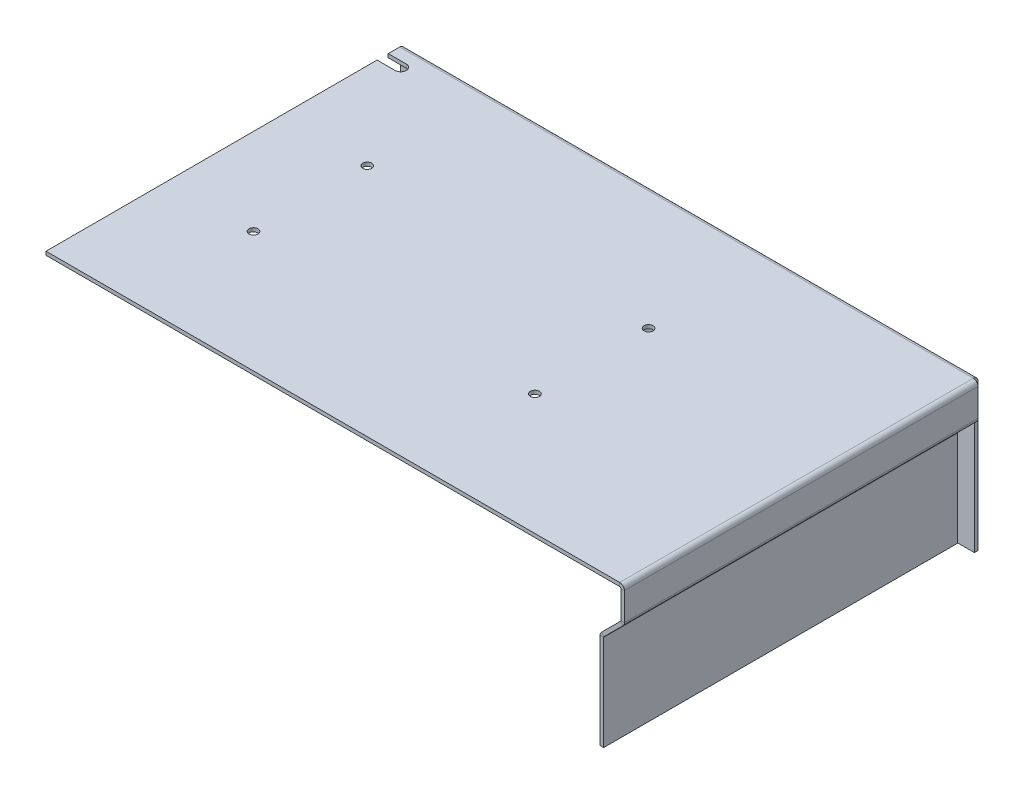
ISO-10303-21;
HEADER;
FILE_DESCRIPTION(('STEP AP214'),'2;1');
FILE_NAME('part.step','',(''),(''),'','','');
FILE_SCHEMA(('AUTOMOTIVE_DESIGN { 1 0 10303 214 1 1 1 1 }'));
ENDSEC;
DATA;
#1=APPLICATION_CONTEXT('core data for automotive mechanical design processes');
#2=APPLICATION_PROTOCOL_DEFINITION('international standard','automotive_design',2000,#1);
#3=PRODUCT_CONTEXT('',#1,'mechanical');
#4=PRODUCT('Part','Part','',(#3));
#5=PRODUCT_RELATED_PRODUCT_CATEGORY('part','',(#4));
#6=PRODUCT_DEFINITION_FORMATION('','',#4);
#7=PRODUCT_DEFINITION_CONTEXT('part definition',#1,'design');
#8=PRODUCT_DEFINITION('design','',#6,#7);
#9=PRODUCT_DEFINITION_SHAPE('','',#8);
#10=(LENGTH_UNIT() NAMED_UNIT(*) SI_UNIT(.MILLI.,.METRE.));
#11=(NAMED_UNIT(*) PLANE_ANGLE_UNIT() SI_UNIT($,.RADIAN.));
#12=(NAMED_UNIT(*) SI_UNIT($,.STERADIAN.) SOLID_ANGLE_UNIT());
#13=UNCERTAINTY_MEASURE_WITH_UNIT(LENGTH_MEASURE(1.E-05),#10,'distance_accuracy_value','');
#14=(GEOMETRIC_REPRESENTATION_CONTEXT(3) GLOBAL_UNCERTAINTY_ASSIGNED_CONTEXT((#13)) GLOBAL_UNIT_ASSIGNED_CONTEXT((#10,
#11,#12)) REPRESENTATION_CONTEXT('',''));
#15=CARTESIAN_POINT('',(0.,0.,0.));
#16=DIRECTION('',(0.,0.,1.));
#17=DIRECTION('',(1.,0.,0.));
#18=AXIS2_PLACEMENT_3D('',#15,#16,#17);
#19=CARTESIAN_POINT('',(-79.5,-1.,49.));
#20=DIRECTION('',(-1.,0.,0.));
#21=DIRECTION('',(0.,0.,1.));
#22=AXIS2_PLACEMENT_3D('',#19,#20,#21);
#23=PLANE('',#22);
#24=DIRECTION('',(0.,1.,0.));
#25=VECTOR('',#24,1.);
#26=CARTESIAN_POINT('',(-79.5,-1.,-45.85));
#27=LINE('',#26,#25);
#28=CARTESIAN_POINT('',(-79.5,-1.,-45.85));
#29=VERTEX_POINT('',#28);
#30=CARTESIAN_POINT('',(-79.5,0.,-45.85));
#31=VERTEX_POINT('',#30);
#32=EDGE_CURVE('E516',#29,#31,#27,.T.);
#33=ORIENTED_EDGE('',*,*,#32,.T.);
#34=DIRECTION('',(0.,0.,1.));
#35=VECTOR('',#34,1.);
#36=CARTESIAN_POINT('',(-79.5,0.,49.));
#37=LINE('',#36,#35);
#38=CARTESIAN_POINT('',(-79.5,0.,-49.));
#39=VERTEX_POINT('',#38);
#40=EDGE_CURVE('E368',#39,#31,#37,.T.);
#41=ORIENTED_EDGE('',*,*,#40,.F.);
#42=DIRECTION('',(0.,1.,0.));
#43=VECTOR('',#42,1.);
#44=CARTESIAN_POINT('',(-79.5,-1.,-49.));
#45=LINE('',#44,#43);
#46=CARTESIAN_POINT('',(-79.5,-1.,-49.));
#47=VERTEX_POINT('',#46);
#48=EDGE_CURVE('E374',#47,#39,#45,.T.);
#49=ORIENTED_EDGE('',*,*,#48,.F.);
#50=DIRECTION('',(0.,0.,1.));
#51=VECTOR('',#50,1.);
#52=CARTESIAN_POINT('',(-79.5,-1.,49.));
#53=LINE('',#52,#51);
#54=EDGE_CURVE('E355',#47,#29,#53,.T.);
#55=ORIENTED_EDGE('',*,*,#54,.T.);
#56=EDGE_LOOP('',(#33,#41,#49,#55));
#57=FACE_BOUND('',#56,.T.);
#58=ADVANCED_FACE('F118',(#57),#23,.T.);
#59=CARTESIAN_POINT('',(-79.5,-1.,49.));
#60=DIRECTION('',(0.,0.,1.));
#61=DIRECTION('',(1.,0.,0.));
#62=AXIS2_PLACEMENT_3D('',#59,#60,#61);
#63=PLANE('',#62);
#64=DIRECTION('',(1.,0.,0.));
#65=VECTOR('',#64,1.);
#66=CARTESIAN_POINT('',(-79.5,0.,49.));
#67=LINE('',#66,#65);
#68=CARTESIAN_POINT('',(-79.5,0.,49.));
#69=VERTEX_POINT('',#68);
#70=CARTESIAN_POINT('',(79.5,0.,49.));
#71=VERTEX_POINT('',#70);
#72=EDGE_CURVE('E371',#69,#71,#67,.T.);
#73=ORIENTED_EDGE('',*,*,#72,.F.);
#74=DIRECTION('',(0.,1.,0.));
#75=VECTOR('',#74,1.);
#76=CARTESIAN_POINT('',(-79.5,-1.,49.));
#77=LINE('',#76,#75);
#78=CARTESIAN_POINT('',(-79.5,-1.,49.));
#79=VERTEX_POINT('',#78);
#80=EDGE_CURVE('E127',#79,#69,#77,.T.);
#81=ORIENTED_EDGE('',*,*,#80,.F.);
#82=DIRECTION('',(1.,0.,0.));
#83=VECTOR('',#82,1.);
#84=CARTESIAN_POINT('',(-79.5,-1.,49.));
#85=LINE('',#84,#83);
#86=CARTESIAN_POINT('',(79.5,-1.,49.));
#87=VERTEX_POINT('',#86);
#88=EDGE_CURVE('E354',#79,#87,#85,.T.);
#89=ORIENTED_EDGE('',*,*,#88,.T.);
#90=DIRECTION('',(0.,1.,0.));
#91=VECTOR('',#90,1.);
#92=CARTESIAN_POINT('',(79.5,-1.,49.));
#93=LINE('',#92,#91);
#94=EDGE_CURVE('E13',#87,#71,#93,.T.);
#95=ORIENTED_EDGE('',*,*,#94,.T.);
#96=EDGE_LOOP('',(#73,#81,#89,#95));
#97=FACE_BOUND('',#96,.T.);
#98=ADVANCED_FACE('F394',(#97),#63,.T.);
#99=DIRECTION('',(0.,1.,0.));
#100=VECTOR('',#99,1.);
#101=CARTESIAN_POINT('',(-79.5,-1.,-42.75));
#102=LINE('',#101,#100);
#103=CARTESIAN_POINT('',(-79.5,-1.,-42.75));
#104=VERTEX_POINT('',#103);
#105=CARTESIAN_POINT('',(-79.5,0.,-42.75));
#106=VERTEX_POINT('',#105);
#107=EDGE_CURVE('E135',#104,#106,#102,.T.);
#108=ORIENTED_EDGE('',*,*,#107,.F.);
#109=EDGE_CURVE('E143',#104,#79,#53,.T.);
#110=ORIENTED_EDGE('',*,*,#109,.T.);
#111=ORIENTED_EDGE('',*,*,#80,.T.);
#112=EDGE_CURVE('E346',#106,#69,#37,.T.);
#113=ORIENTED_EDGE('',*,*,#112,.F.);
#114=EDGE_LOOP('',(#108,#110,#111,#113));
#115=FACE_BOUND('',#114,.T.);
#116=ADVANCED_FACE('F120',(#115),#23,.T.);
#117=CARTESIAN_POINT('',(0.,-1.,0.));
#118=DIRECTION('',(0.,-1.,0.));
#119=DIRECTION('',(0.,0.,-1.));
#120=AXIS2_PLACEMENT_3D('',#117,#118,#119);
#121=PLANE('',#120);
#122=CARTESIAN_POINT('',(-55.5,-1.,-16.));
#123=DIRECTION('',(0.,-1.,0.));
#124=DIRECTION('',(0.,0.,-1.));
#125=AXIS2_PLACEMENT_3D('',#122,#123,#124);
#126=CIRCLE('',#125,1.25);
#127=CARTESIAN_POINT('',(-55.5,-1.,-17.25));
#128=VERTEX_POINT('',#127);
#129=EDGE_CURVE('E575',#128,#128,#126,.T.);
#130=ORIENTED_EDGE('',*,*,#129,.F.);
#131=EDGE_LOOP('',(#130));
#132=FACE_BOUND('',#131,.T.);
#133=CARTESIAN_POINT('',(22.5,-1.,-16.));
#134=DIRECTION('',(0.,-1.,0.));
#135=DIRECTION('',(0.,0.,-1.));
#136=AXIS2_PLACEMENT_3D('',#133,#134,#135);
#137=CIRCLE('',#136,1.25);
#138=CARTESIAN_POINT('',(22.5,-1.,-17.25));
#139=VERTEX_POINT('',#138);
#140=EDGE_CURVE('E569',#139,#139,#137,.T.);
#141=ORIENTED_EDGE('',*,*,#140,.F.);
#142=EDGE_LOOP('',(#141));
#143=FACE_BOUND('',#142,.T.);
#144=CARTESIAN_POINT('',(22.5,-1.,15.5));
#145=DIRECTION('',(0.,-1.,0.));
#146=DIRECTION('',(0.,0.,-1.));
#147=AXIS2_PLACEMENT_3D('',#144,#145,#146);
#148=CIRCLE('',#147,1.25);
#149=CARTESIAN_POINT('',(22.5,-1.,14.25));
#150=VERTEX_POINT('',#149);
#151=EDGE_CURVE('E563',#150,#150,#148,.T.);
#152=ORIENTED_EDGE('',*,*,#151,.F.);
#153=EDGE_LOOP('',(#152));
#154=FACE_BOUND('',#153,.T.);
#155=CARTESIAN_POINT('',(-55.5,-1.,15.5));
#156=DIRECTION('',(0.,-1.,0.));
#157=DIRECTION('',(0.,0.,-1.));
#158=AXIS2_PLACEMENT_3D('',#155,#156,#157);
#159=CIRCLE('',#158,1.25);
#160=CARTESIAN_POINT('',(-55.5,-1.,14.25));
#161=VERTEX_POINT('',#160);
#162=EDGE_CURVE('E555',#161,#161,#159,.T.);
#163=ORIENTED_EDGE('',*,*,#162,.F.);
#164=EDGE_LOOP('',(#163));
#165=FACE_BOUND('',#164,.T.);
#166=DIRECTION('',(-1.,0.,0.));
#167=VECTOR('',#166,1.);
#168=CARTESIAN_POINT('',(-79.5,-1.,-45.85));
#169=LINE('',#168,#167);
#170=CARTESIAN_POINT('',(-74.5,-1.,-45.85));
#171=VERTEX_POINT('',#170);
#172=EDGE_CURVE('E347',#171,#29,#169,.T.);
#173=ORIENTED_EDGE('',*,*,#172,.T.);
#174=ORIENTED_EDGE('',*,*,#54,.F.);
#175=DIRECTION('',(-1.,0.,0.));
#176=VECTOR('',#175,1.);
#177=CARTESIAN_POINT('',(-79.5,-1.,-49.));
#178=LINE('',#177,#176);
#179=CARTESIAN_POINT('',(79.5,-1.,-49.));
#180=VERTEX_POINT('',#179);
#181=EDGE_CURVE('E356',#180,#47,#178,.T.);
#182=ORIENTED_EDGE('',*,*,#181,.F.);
#183=DIRECTION('',(0.,0.,-1.));
#184=VECTOR('',#183,1.);
#185=CARTESIAN_POINT('',(79.5,-1.,49.));
#186=LINE('',#185,#184);
#187=EDGE_CURVE('E359',#87,#180,#186,.T.);
#188=ORIENTED_EDGE('',*,*,#187,.F.);
#189=ORIENTED_EDGE('',*,*,#88,.F.);
#190=ORIENTED_EDGE('',*,*,#109,.F.);
#191=DIRECTION('',(1.,0.,0.));
#192=VECTOR('',#191,1.);
#193=CARTESIAN_POINT('',(-79.5,-1.,-42.75));
#194=LINE('',#193,#192);
#195=CARTESIAN_POINT('',(-74.5,-1.,-42.75));
#196=VERTEX_POINT('',#195);
#197=EDGE_CURVE('E336',#104,#196,#194,.T.);
#198=ORIENTED_EDGE('',*,*,#197,.T.);
#199=CARTESIAN_POINT('',(-74.5,-1.,-44.3));
#200=DIRECTION('',(0.,1.,0.));
#201=DIRECTION('',(0.,0.,1.));
#202=AXIS2_PLACEMENT_3D('',#199,#200,#201);
#203=CIRCLE('',#202,1.55);
#204=EDGE_CURVE('E342',#196,#171,#203,.T.);
#205=ORIENTED_EDGE('',*,*,#204,.T.);
#206=EDGE_LOOP('',(#173,#174,#182,#188,#189,#190,#198,#205));
#207=FACE_BOUND('',#206,.T.);
#208=ADVANCED_FACE('F351',(#132,#143,#154,#165,#207),#121,.T.);
#209=CARTESIAN_POINT('',(0.,0.,0.));
#210=DIRECTION('',(0.,-1.,0.));
#211=DIRECTION('',(0.,0.,-1.));
#212=AXIS2_PLACEMENT_3D('',#209,#210,#211);
#213=PLANE('',#212);
#214=CARTESIAN_POINT('',(-55.5,0.,-16.));
#215=DIRECTION('',(0.,1.,0.));
#216=DIRECTION('',(0.,0.,1.));
#217=AXIS2_PLACEMENT_3D('',#214,#215,#216);
#218=CIRCLE('',#217,1.25);
#219=CARTESIAN_POINT('',(-55.5,0.,-14.75));
#220=VERTEX_POINT('',#219);
#221=EDGE_CURVE('E578',#220,#220,#218,.T.);
#222=ORIENTED_EDGE('',*,*,#221,.F.);
#223=EDGE_LOOP('',(#222));
#224=FACE_BOUND('',#223,.T.);
#225=CARTESIAN_POINT('',(22.5,0.,-16.));
#226=DIRECTION('',(0.,1.,0.));
#227=DIRECTION('',(0.,0.,1.));
#228=AXIS2_PLACEMENT_3D('',#225,#226,#227);
#229=CIRCLE('',#228,1.25);
#230=CARTESIAN_POINT('',(22.5,0.,-14.75));
#231=VERTEX_POINT('',#230);
#232=EDGE_CURVE('E572',#231,#231,#229,.T.);
#233=ORIENTED_EDGE('',*,*,#232,.F.);
#234=EDGE_LOOP('',(#233));
#235=FACE_BOUND('',#234,.T.);
#236=CARTESIAN_POINT('',(22.5,0.,15.5));
#237=DIRECTION('',(0.,1.,0.));
#238=DIRECTION('',(0.,0.,1.));
#239=AXIS2_PLACEMENT_3D('',#236,#237,#238);
#240=CIRCLE('',#239,1.25);
#241=CARTESIAN_POINT('',(22.5,0.,16.75));
#242=VERTEX_POINT('',#241);
#243=EDGE_CURVE('E566',#242,#242,#240,.T.);
#244=ORIENTED_EDGE('',*,*,#243,.F.);
#245=EDGE_LOOP('',(#244));
#246=FACE_BOUND('',#245,.T.);
#247=CARTESIAN_POINT('',(-55.5,0.,15.5));
#248=DIRECTION('',(0.,1.,0.));
#249=DIRECTION('',(0.,0.,1.));
#250=AXIS2_PLACEMENT_3D('',#247,#248,#249);
#251=CIRCLE('',#250,1.25);
#252=CARTESIAN_POINT('',(-55.5,0.,16.75));
#253=VERTEX_POINT('',#252);
#254=EDGE_CURVE('E560',#253,#253,#251,.T.);
#255=ORIENTED_EDGE('',*,*,#254,.F.);
#256=EDGE_LOOP('',(#255));
#257=FACE_BOUND('',#256,.T.);
#258=ORIENTED_EDGE('',*,*,#40,.T.);
#259=DIRECTION('',(-1.,0.,0.));
#260=VECTOR('',#259,1.);
#261=CARTESIAN_POINT('',(-79.5,0.,-45.85));
#262=LINE('',#261,#260);
#263=CARTESIAN_POINT('',(-74.5,0.,-45.85));
#264=VERTEX_POINT('',#263);
#265=EDGE_CURVE('E343',#264,#31,#262,.T.);
#266=ORIENTED_EDGE('',*,*,#265,.F.);
#267=CARTESIAN_POINT('',(-74.5,0.,-44.3));
#268=DIRECTION('',(0.,1.,0.));
#269=DIRECTION('',(0.,0.,1.));
#270=AXIS2_PLACEMENT_3D('',#267,#268,#269);
#271=CIRCLE('',#270,1.55);
#272=CARTESIAN_POINT('',(-74.5,0.,-42.75));
#273=VERTEX_POINT('',#272);
#274=EDGE_CURVE('E550',#273,#264,#271,.T.);
#275=ORIENTED_EDGE('',*,*,#274,.F.);
#276=DIRECTION('',(1.,0.,0.));
#277=VECTOR('',#276,1.);
#278=CARTESIAN_POINT('',(-79.5,0.,-42.75));
#279=LINE('',#278,#277);
#280=EDGE_CURVE('E553',#106,#273,#279,.T.);
#281=ORIENTED_EDGE('',*,*,#280,.F.);
#282=ORIENTED_EDGE('',*,*,#112,.T.);
#283=ORIENTED_EDGE('',*,*,#72,.T.);
#284=DIRECTION('',(0.,0.,-1.));
#285=VECTOR('',#284,1.);
#286=CARTESIAN_POINT('',(79.5,0.,49.));
#287=LINE('',#286,#285);
#288=CARTESIAN_POINT('',(79.5,0.,-49.));
#289=VERTEX_POINT('',#288);
#290=EDGE_CURVE('E212',#71,#289,#287,.T.);
#291=ORIENTED_EDGE('',*,*,#290,.T.);
#292=DIRECTION('',(-1.,0.,0.));
#293=VECTOR('',#292,1.);
#294=CARTESIAN_POINT('',(-79.5,0.,-49.));
#295=LINE('',#294,#293);
#296=EDGE_CURVE('E365',#289,#39,#295,.T.);
#297=ORIENTED_EDGE('',*,*,#296,.T.);
#298=EDGE_LOOP('',(#258,#266,#275,#281,#282,#283,#291,#297));
#299=FACE_BOUND('',#298,.T.);
#300=ADVANCED_FACE('F391',(#224,#235,#246,#257,#299),#213,.F.);
#301=CARTESIAN_POINT('',(-79.5,-1.3,-49.));
#302=DIRECTION('',(-1.,0.,0.));
#303=DIRECTION('',(0.,0.,1.));
#304=AXIS2_PLACEMENT_3D('',#301,#302,#303);
#305=PLANE('',#304);
#306=DIRECTION('',(0.,0.,-1.));
#307=VECTOR('',#306,1.);
#308=CARTESIAN_POINT('',(-79.5,-1.3,-50.2999999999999));
#309=LINE('',#308,#307);
#310=CARTESIAN_POINT('',(-79.5,-1.3,-49.3));
#311=VERTEX_POINT('',#310);
#312=CARTESIAN_POINT('',(-79.5,-1.3,-50.3));
#313=VERTEX_POINT('',#312);
#314=EDGE_CURVE('E179',#311,#313,#309,.T.);
#315=ORIENTED_EDGE('',*,*,#314,.F.);
#316=CARTESIAN_POINT('',(-79.5,-1.3,-49.));
#317=DIRECTION('',(1.,0.,0.));
#318=DIRECTION('',(0.,0.,-1.));
#319=AXIS2_PLACEMENT_3D('',#316,#317,#318);
#320=CIRCLE('',#319,0.300000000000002);
#321=EDGE_CURVE('E389',#47,#311,#320,.F.);
#322=ORIENTED_EDGE('',*,*,#321,.F.);
#323=ORIENTED_EDGE('',*,*,#48,.T.);
#324=CARTESIAN_POINT('',(-79.5,-1.3,-49.));
#325=DIRECTION('',(1.,0.,0.));
#326=DIRECTION('',(0.,0.,-1.));
#327=AXIS2_PLACEMENT_3D('',#324,#325,#326);
#328=CIRCLE('',#327,1.3);
#329=EDGE_CURVE('E157',#39,#313,#328,.F.);
#330=ORIENTED_EDGE('',*,*,#329,.T.);
#331=EDGE_LOOP('',(#315,#322,#323,#330));
#332=FACE_BOUND('',#331,.T.);
#333=ADVANCED_FACE('F586',(#332),#305,.T.);
#334=CARTESIAN_POINT('',(79.5,-1.3,-49.));
#335=DIRECTION('',(-1.,0.,0.));
#336=DIRECTION('',(0.,0.,1.));
#337=AXIS2_PLACEMENT_3D('',#334,#335,#336);
#338=PLANE('',#337);
#339=CARTESIAN_POINT('',(79.5,-1.3,-49.));
#340=DIRECTION('',(1.,0.,0.));
#341=DIRECTION('',(0.,0.,-1.));
#342=AXIS2_PLACEMENT_3D('',#339,#340,#341);
#343=CIRCLE('',#342,0.300000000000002);
#344=CARTESIAN_POINT('',(79.5,-1.3,-49.3));
#345=VERTEX_POINT('',#344);
#346=EDGE_CURVE('E409',#345,#180,#343,.T.);
#347=ORIENTED_EDGE('',*,*,#346,.F.);
#348=DIRECTION('',(0.,0.,-1.));
#349=VECTOR('',#348,1.);
#350=CARTESIAN_POINT('',(79.5,-1.3,-49.3));
#351=LINE('',#350,#349);
#352=CARTESIAN_POINT('',(79.5,-1.29999999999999,-50.3));
#353=VERTEX_POINT('',#352);
#354=EDGE_CURVE('E387',#345,#353,#351,.T.);
#355=ORIENTED_EDGE('',*,*,#354,.T.);
#356=CARTESIAN_POINT('',(79.5,-1.3,-49.));
#357=DIRECTION('',(1.,0.,0.));
#358=DIRECTION('',(0.,0.,-1.));
#359=AXIS2_PLACEMENT_3D('',#356,#357,#358);
#360=CIRCLE('',#359,1.3);
#361=EDGE_CURVE('E186',#353,#289,#360,.T.);
#362=ORIENTED_EDGE('',*,*,#361,.T.);
#363=DIRECTION('',(0.,1.,0.));
#364=VECTOR('',#363,1.);
#365=CARTESIAN_POINT('',(79.5,-1.,-49.));
#366=LINE('',#365,#364);
#367=EDGE_CURVE('E122',#180,#289,#366,.T.);
#368=ORIENTED_EDGE('',*,*,#367,.F.);
#369=EDGE_LOOP('',(#347,#355,#362,#368));
#370=FACE_BOUND('',#369,.T.);
#371=ADVANCED_FACE('F385',(#370),#338,.F.);
#372=CARTESIAN_POINT('',(79.5,-1.3,-49.));
#373=DIRECTION('',(1.,0.,0.));
#374=DIRECTION('',(0.,0.,-1.));
#375=AXIS2_PLACEMENT_3D('',#372,#373,#374);
#376=CYLINDRICAL_SURFACE('',#375,1.3);
#377=ORIENTED_EDGE('',*,*,#296,.F.);
#378=ORIENTED_EDGE('',*,*,#361,.F.);
#379=DIRECTION('',(1.,0.,0.));
#380=VECTOR('',#379,1.);
#381=CARTESIAN_POINT('',(0.,-1.29999999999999,-50.3));
#382=LINE('',#381,#380);
#383=EDGE_CURVE('E418',#313,#353,#382,.T.);
#384=ORIENTED_EDGE('',*,*,#383,.F.);
#385=ORIENTED_EDGE('',*,*,#329,.F.);
#386=EDGE_LOOP('',(#377,#378,#384,#385));
#387=FACE_BOUND('',#386,.T.);
#388=ADVANCED_FACE('F383',(#387),#376,.T.);
#389=CARTESIAN_POINT('',(79.5,-1.3,-49.));
#390=DIRECTION('',(1.,0.,0.));
#391=DIRECTION('',(0.,0.,-1.));
#392=AXIS2_PLACEMENT_3D('',#389,#390,#391);
#393=CYLINDRICAL_SURFACE('',#392,0.300000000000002);
#394=ORIENTED_EDGE('',*,*,#181,.T.);
#395=ORIENTED_EDGE('',*,*,#321,.T.);
#396=DIRECTION('',(-1.,0.,0.));
#397=VECTOR('',#396,1.);
#398=CARTESIAN_POINT('',(-79.5,-1.3,-49.3));
#399=LINE('',#398,#397);
#400=EDGE_CURVE('E415',#311,#345,#399,.F.);
#401=ORIENTED_EDGE('',*,*,#400,.T.);
#402=ORIENTED_EDGE('',*,*,#346,.T.);
#403=EDGE_LOOP('',(#394,#395,#401,#402));
#404=FACE_BOUND('',#403,.T.);
#405=ADVANCED_FACE('F629',(#404),#393,.F.);
#406=CARTESIAN_POINT('',(79.5,-0.999999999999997,-50.3));
#407=DIRECTION('',(1.,0.,0.));
#408=DIRECTION('',(0.,1.,0.));
#409=AXIS2_PLACEMENT_3D('',#406,#407,#408);
#410=PLANE('',#409);
#411=DIRECTION('',(0.,1.,0.));
#412=VECTOR('',#411,1.);
#413=CARTESIAN_POINT('',(79.5,-0.999999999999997,-50.3));
#414=LINE('',#413,#412);
#415=CARTESIAN_POINT('',(79.4999999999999,-42.,-50.3000000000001));
#416=VERTEX_POINT('',#415);
#417=EDGE_CURVE('E431',#416,#353,#414,.T.);
#418=ORIENTED_EDGE('',*,*,#417,.T.);
#419=ORIENTED_EDGE('',*,*,#354,.F.);
#420=DIRECTION('',(0.,-1.,0.));
#421=VECTOR('',#420,1.);
#422=CARTESIAN_POINT('',(79.5,0.,-49.3));
#423=LINE('',#422,#421);
#424=CARTESIAN_POINT('',(79.4999999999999,-42.,-49.3000000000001));
#425=VERTEX_POINT('',#424);
#426=EDGE_CURVE('E423',#425,#345,#423,.F.);
#427=ORIENTED_EDGE('',*,*,#426,.F.);
#428=DIRECTION('',(0.,0.,1.));
#429=VECTOR('',#428,1.);
#430=CARTESIAN_POINT('',(79.4999999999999,-42.,-50.3000000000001));
#431=LINE('',#430,#429);
#432=EDGE_CURVE('E411',#416,#425,#431,.T.);
#433=ORIENTED_EDGE('',*,*,#432,.F.);
#434=EDGE_LOOP('',(#418,#419,#427,#433));
#435=FACE_BOUND('',#434,.T.);
#436=ADVANCED_FACE('F632',(#435),#410,.T.);
#437=CARTESIAN_POINT('',(-79.5,-42.,-50.3000000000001));
#438=DIRECTION('',(-1.,0.,0.));
#439=DIRECTION('',(0.,-1.,0.));
#440=AXIS2_PLACEMENT_3D('',#437,#438,#439);
#441=PLANE('',#440);
#442=DIRECTION('',(0.,1.,0.));
#443=VECTOR('',#442,1.);
#444=CARTESIAN_POINT('',(-79.5,2.0105868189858E-13,-49.3));
#445=LINE('',#444,#443);
#446=CARTESIAN_POINT('',(-79.5,-42.,-49.3000000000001));
#447=VERTEX_POINT('',#446);
#448=EDGE_CURVE('E206',#311,#447,#445,.F.);
#449=ORIENTED_EDGE('',*,*,#448,.F.);
#450=ORIENTED_EDGE('',*,*,#314,.T.);
#451=DIRECTION('',(0.,-1.,0.));
#452=VECTOR('',#451,1.);
#453=CARTESIAN_POINT('',(-79.5,-42.,-50.3000000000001));
#454=LINE('',#453,#452);
#455=CARTESIAN_POINT('',(-79.5,-42.,-50.3000000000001));
#456=VERTEX_POINT('',#455);
#457=EDGE_CURVE('E426',#313,#456,#454,.T.);
#458=ORIENTED_EDGE('',*,*,#457,.T.);
#459=DIRECTION('',(0.,0.,1.));
#460=VECTOR('',#459,1.);
#461=CARTESIAN_POINT('',(-79.5,-42.,-50.3000000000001));
#462=LINE('',#461,#460);
#463=EDGE_CURVE('E434',#456,#447,#462,.T.);
#464=ORIENTED_EDGE('',*,*,#463,.T.);
#465=EDGE_LOOP('',(#449,#450,#458,#464));
#466=FACE_BOUND('',#465,.T.);
#467=ADVANCED_FACE('F636',(#466),#441,.T.);
#468=CARTESIAN_POINT('',(0.,1.77640794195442E-13,-50.3));
#469=DIRECTION('',(0.,0.,-1.));
#470=DIRECTION('',(0.,1.,0.));
#471=AXIS2_PLACEMENT_3D('',#468,#469,#470);
#472=PLANE('',#471);
#473=ORIENTED_EDGE('',*,*,#457,.F.);
#474=ORIENTED_EDGE('',*,*,#383,.T.);
#475=ORIENTED_EDGE('',*,*,#417,.F.);
#476=DIRECTION('',(1.,0.,0.));
#477=VECTOR('',#476,1.);
#478=CARTESIAN_POINT('',(79.4999999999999,-42.,-50.3000000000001));
#479=LINE('',#478,#477);
#480=EDGE_CURVE('E428',#456,#416,#479,.T.);
#481=ORIENTED_EDGE('',*,*,#480,.F.);
#482=EDGE_LOOP('',(#473,#474,#475,#481));
#483=FACE_BOUND('',#482,.T.);
#484=ADVANCED_FACE('F639',(#483),#472,.T.);
#485=CARTESIAN_POINT('',(0.,1.74149312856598E-13,-49.3));
#486=DIRECTION('',(0.,0.,-1.));
#487=DIRECTION('',(0.,1.,0.));
#488=AXIS2_PLACEMENT_3D('',#485,#486,#487);
#489=PLANE('',#488);
#490=ORIENTED_EDGE('',*,*,#400,.F.);
#491=ORIENTED_EDGE('',*,*,#448,.T.);
#492=DIRECTION('',(-1.,0.,0.));
#493=VECTOR('',#492,1.);
#494=CARTESIAN_POINT('',(0.,-42.,-49.3000000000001));
#495=LINE('',#494,#493);
#496=EDGE_CURVE('E421',#447,#425,#495,.F.);
#497=ORIENTED_EDGE('',*,*,#496,.T.);
#498=ORIENTED_EDGE('',*,*,#426,.T.);
#499=EDGE_LOOP('',(#490,#491,#497,#498));
#500=FACE_BOUND('',#499,.T.);
#501=ADVANCED_FACE('F644',(#500),#489,.F.);
#502=CARTESIAN_POINT('',(79.4999999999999,-42.,-50.3000000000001));
#503=DIRECTION('',(0.,-1.,0.));
#504=DIRECTION('',(0.,0.,-1.));
#505=AXIS2_PLACEMENT_3D('',#502,#503,#504);
#506=PLANE('',#505);
#507=ORIENTED_EDGE('',*,*,#496,.F.);
#508=ORIENTED_EDGE('',*,*,#463,.F.);
#509=ORIENTED_EDGE('',*,*,#480,.T.);
#510=ORIENTED_EDGE('',*,*,#432,.T.);
#511=EDGE_LOOP('',(#507,#508,#509,#510));
#512=FACE_BOUND('',#511,.T.);
#513=ADVANCED_FACE('F641',(#512),#506,.T.);
#514=CARTESIAN_POINT('',(79.5,-1.3,-49.));
#515=DIRECTION('',(0.,0.,-1.));
#516=DIRECTION('',(-1.,0.,0.));
#517=AXIS2_PLACEMENT_3D('',#514,#515,#516);
#518=PLANE('',#517);
#519=DIRECTION('',(1.,0.,0.));
#520=VECTOR('',#519,1.);
#521=CARTESIAN_POINT('',(80.8,-1.29999999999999,-49.));
#522=LINE('',#521,#520);
#523=CARTESIAN_POINT('',(79.8,-1.3,-49.));
#524=VERTEX_POINT('',#523);
#525=CARTESIAN_POINT('',(80.8,-1.29999999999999,-49.));
#526=VERTEX_POINT('',#525);
#527=EDGE_CURVE('E228',#524,#526,#522,.T.);
#528=ORIENTED_EDGE('',*,*,#527,.F.);
#529=CARTESIAN_POINT('',(79.5,-1.3,-49.));
#530=DIRECTION('',(0.,0.,1.));
#531=DIRECTION('',(1.,0.,0.));
#532=AXIS2_PLACEMENT_3D('',#529,#530,#531);
#533=CIRCLE('',#532,0.299999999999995);
#534=EDGE_CURVE('E379',#180,#524,#533,.F.);
#535=ORIENTED_EDGE('',*,*,#534,.F.);
#536=ORIENTED_EDGE('',*,*,#367,.T.);
#537=CARTESIAN_POINT('',(79.5,-1.3,-49.));
#538=DIRECTION('',(0.,0.,1.));
#539=DIRECTION('',(1.,0.,0.));
#540=AXIS2_PLACEMENT_3D('',#537,#538,#539);
#541=CIRCLE('',#540,1.29999999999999);
#542=EDGE_CURVE('E166',#289,#526,#541,.F.);
#543=ORIENTED_EDGE('',*,*,#542,.T.);
#544=EDGE_LOOP('',(#528,#535,#536,#543));
#545=FACE_BOUND('',#544,.T.);
#546=ADVANCED_FACE('F378',(#545),#518,.T.);
#547=CARTESIAN_POINT('',(79.5,-1.3,49.));
#548=DIRECTION('',(0.,0.,-1.));
#549=DIRECTION('',(-1.,0.,0.));
#550=AXIS2_PLACEMENT_3D('',#547,#548,#549);
#551=PLANE('',#550);
#552=CARTESIAN_POINT('',(79.5,-1.3,49.));
#553=DIRECTION('',(0.,0.,1.));
#554=DIRECTION('',(1.,0.,0.));
#555=AXIS2_PLACEMENT_3D('',#552,#553,#554);
#556=CIRCLE('',#555,0.299999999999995);
#557=CARTESIAN_POINT('',(79.8,-1.3,49.));
#558=VERTEX_POINT('',#557);
#559=EDGE_CURVE('E399',#558,#87,#556,.T.);
#560=ORIENTED_EDGE('',*,*,#559,.F.);
#561=DIRECTION('',(1.,0.,0.));
#562=VECTOR('',#561,1.);
#563=CARTESIAN_POINT('',(79.8,-1.3,49.));
#564=LINE('',#563,#562);
#565=CARTESIAN_POINT('',(80.8,-1.29999999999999,49.));
#566=VERTEX_POINT('',#565);
#567=EDGE_CURVE('E443',#558,#566,#564,.T.);
#568=ORIENTED_EDGE('',*,*,#567,.T.);
#569=CARTESIAN_POINT('',(79.5,-1.3,49.));
#570=DIRECTION('',(0.,0.,1.));
#571=DIRECTION('',(1.,0.,0.));
#572=AXIS2_PLACEMENT_3D('',#569,#570,#571);
#573=CIRCLE('',#572,1.29999999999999);
#574=EDGE_CURVE('E233',#566,#71,#573,.T.);
#575=ORIENTED_EDGE('',*,*,#574,.T.);
#576=ORIENTED_EDGE('',*,*,#94,.F.);
#577=EDGE_LOOP('',(#560,#568,#575,#576));
#578=FACE_BOUND('',#577,.T.);
#579=ADVANCED_FACE('F398',(#578),#551,.F.);
#580=CARTESIAN_POINT('',(79.5,-1.3,49.));
#581=DIRECTION('',(0.,0.,1.));
#582=DIRECTION('',(1.,0.,0.));
#583=AXIS2_PLACEMENT_3D('',#580,#581,#582);
#584=CYLINDRICAL_SURFACE('',#583,1.29999999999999);
#585=ORIENTED_EDGE('',*,*,#290,.F.);
#586=ORIENTED_EDGE('',*,*,#574,.F.);
#587=DIRECTION('',(0.,0.,1.));
#588=VECTOR('',#587,1.);
#589=CARTESIAN_POINT('',(80.8,-1.29999999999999,0.));
#590=LINE('',#589,#588);
#591=EDGE_CURVE('E445',#526,#566,#590,.T.);
#592=ORIENTED_EDGE('',*,*,#591,.F.);
#593=ORIENTED_EDGE('',*,*,#542,.F.);
#594=EDGE_LOOP('',(#585,#586,#592,#593));
#595=FACE_BOUND('',#594,.T.);
#596=ADVANCED_FACE('F656',(#595),#584,.T.);
#597=CARTESIAN_POINT('',(79.5,-1.3,49.));
#598=DIRECTION('',(0.,0.,1.));
#599=DIRECTION('',(1.,0.,0.));
#600=AXIS2_PLACEMENT_3D('',#597,#598,#599);
#601=CYLINDRICAL_SURFACE('',#600,0.299999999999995);
#602=ORIENTED_EDGE('',*,*,#187,.T.);
#603=ORIENTED_EDGE('',*,*,#534,.T.);
#604=DIRECTION('',(0.,0.,-1.));
#605=VECTOR('',#604,1.);
#606=CARTESIAN_POINT('',(79.8,-1.3,-49.));
#607=LINE('',#606,#605);
#608=EDGE_CURVE('E403',#524,#558,#607,.F.);
#609=ORIENTED_EDGE('',*,*,#608,.T.);
#610=ORIENTED_EDGE('',*,*,#559,.T.);
#611=EDGE_LOOP('',(#602,#603,#609,#610));
#612=FACE_BOUND('',#611,.T.);
#613=ADVANCED_FACE('F402',(#612),#601,.F.);
#614=CARTESIAN_POINT('',(80.8,-0.999999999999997,49.));
#615=DIRECTION('',(0.,0.,1.));
#616=DIRECTION('',(1.,0.,0.));
#617=AXIS2_PLACEMENT_3D('',#614,#615,#616);
#618=PLANE('',#617);
#619=DIRECTION('',(0.,1.,0.));
#620=VECTOR('',#619,1.);
#621=CARTESIAN_POINT('',(80.8,-0.999999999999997,49.));
#622=LINE('',#621,#620);
#623=CARTESIAN_POINT('',(80.8,-9.,49.));
#624=VERTEX_POINT('',#623);
#625=EDGE_CURVE('E258',#624,#566,#622,.T.);
#626=ORIENTED_EDGE('',*,*,#625,.T.);
#627=ORIENTED_EDGE('',*,*,#567,.F.);
#628=DIRECTION('',(0.,-1.,0.));
#629=VECTOR('',#628,1.);
#630=CARTESIAN_POINT('',(79.8,2.75821032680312E-13,49.));
#631=LINE('',#630,#629);
#632=CARTESIAN_POINT('',(79.8,-9.,49.));
#633=VERTEX_POINT('',#632);
#634=EDGE_CURVE('E450',#633,#558,#631,.F.);
#635=ORIENTED_EDGE('',*,*,#634,.F.);
#636=DIRECTION('',(-1.,0.,0.));
#637=VECTOR('',#636,1.);
#638=CARTESIAN_POINT('',(80.8,-9.,49.));
#639=LINE('',#638,#637);
#640=EDGE_CURVE('E404',#624,#633,#639,.T.);
#641=ORIENTED_EDGE('',*,*,#640,.F.);
#642=EDGE_LOOP('',(#626,#627,#635,#641));
#643=FACE_BOUND('',#642,.T.);
#644=ADVANCED_FACE('F661',(#643),#618,.T.);
#645=CARTESIAN_POINT('',(80.8,-9.,-49.));
#646=DIRECTION('',(0.,0.,-1.));
#647=DIRECTION('',(-1.,0.,0.));
#648=AXIS2_PLACEMENT_3D('',#645,#646,#647);
#649=PLANE('',#648);
#650=DIRECTION('',(0.,1.,0.));
#651=VECTOR('',#650,1.);
#652=CARTESIAN_POINT('',(79.8,2.75821032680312E-13,-49.));
#653=LINE('',#652,#651);
#654=CARTESIAN_POINT('',(79.8,-9.,-49.));
#655=VERTEX_POINT('',#654);
#656=EDGE_CURVE('E249',#524,#655,#653,.F.);
#657=ORIENTED_EDGE('',*,*,#656,.F.);
#658=ORIENTED_EDGE('',*,*,#527,.T.);
#659=DIRECTION('',(0.,-1.,0.));
#660=VECTOR('',#659,1.);
#661=CARTESIAN_POINT('',(80.8,-9.,-49.));
#662=LINE('',#661,#660);
#663=CARTESIAN_POINT('',(80.8,-9.,-49.));
#664=VERTEX_POINT('',#663);
#665=EDGE_CURVE('E452',#526,#664,#662,.T.);
#666=ORIENTED_EDGE('',*,*,#665,.T.);
#667=DIRECTION('',(-1.,0.,0.));
#668=VECTOR('',#667,1.);
#669=CARTESIAN_POINT('',(80.8,-9.,-49.));
#670=LINE('',#669,#668);
#671=EDGE_CURVE('E457',#664,#655,#670,.T.);
#672=ORIENTED_EDGE('',*,*,#671,.T.);
#673=EDGE_LOOP('',(#657,#658,#666,#672));
#674=FACE_BOUND('',#673,.T.);
#675=ADVANCED_FACE('F664',(#674),#649,.T.);
#676=CARTESIAN_POINT('',(80.8,2.79312514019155E-13,0.));
#677=DIRECTION('',(1.,0.,0.));
#678=DIRECTION('',(0.,1.,0.));
#679=AXIS2_PLACEMENT_3D('',#676,#677,#678);
#680=PLANE('',#679);
#681=ORIENTED_EDGE('',*,*,#665,.F.);
#682=ORIENTED_EDGE('',*,*,#591,.T.);
#683=ORIENTED_EDGE('',*,*,#625,.F.);
#684=DIRECTION('',(0.,0.,1.));
#685=VECTOR('',#684,1.);
#686=CARTESIAN_POINT('',(80.8,-9.,49.));
#687=LINE('',#686,#685);
#688=EDGE_CURVE('E454',#664,#624,#687,.T.);
#689=ORIENTED_EDGE('',*,*,#688,.F.);
#690=EDGE_LOOP('',(#681,#682,#683,#689));
#691=FACE_BOUND('',#690,.T.);
#692=ADVANCED_FACE('F667',(#691),#680,.T.);
#693=CARTESIAN_POINT('',(79.8,2.75821032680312E-13,0.));
#694=DIRECTION('',(1.,0.,0.));
#695=DIRECTION('',(0.,1.,0.));
#696=AXIS2_PLACEMENT_3D('',#693,#694,#695);
#697=PLANE('',#696);
#698=ORIENTED_EDGE('',*,*,#608,.F.);
#699=ORIENTED_EDGE('',*,*,#656,.T.);
#700=DIRECTION('',(0.,0.,-1.));
#701=VECTOR('',#700,1.);
#702=CARTESIAN_POINT('',(79.8,-9.,0.));
#703=LINE('',#702,#701);
#704=EDGE_CURVE('E448',#655,#633,#703,.F.);
#705=ORIENTED_EDGE('',*,*,#704,.T.);
#706=ORIENTED_EDGE('',*,*,#634,.T.);
#707=EDGE_LOOP('',(#698,#699,#705,#706));
#708=FACE_BOUND('',#707,.T.);
#709=ADVANCED_FACE('F672',(#708),#697,.F.);
#710=CARTESIAN_POINT('',(79.5,-9.00000000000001,-49.));
#711=DIRECTION('',(0.,0.,-1.));
#712=DIRECTION('',(-1.,0.,0.));
#713=AXIS2_PLACEMENT_3D('',#710,#711,#712);
#714=PLANE('',#713);
#715=DIRECTION('',(0.707106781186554,-0.707106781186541,0.));
#716=VECTOR('',#715,1.);
#717=CARTESIAN_POINT('',(80.4192388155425,-9.91923881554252,-49.));
#718=LINE('',#717,#716);
#719=CARTESIAN_POINT('',(79.712132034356,-9.21213203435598,-49.));
#720=VERTEX_POINT('',#719);
#721=CARTESIAN_POINT('',(80.4192388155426,-9.91923881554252,-48.9999999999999));
#722=VERTEX_POINT('',#721);
#723=EDGE_CURVE('E270',#720,#722,#718,.T.);
#724=ORIENTED_EDGE('',*,*,#723,.F.);
#725=CARTESIAN_POINT('',(79.5,-9.00000000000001,-49.));
#726=DIRECTION('',(0.,0.,1.));
#727=DIRECTION('',(1.,0.,0.));
#728=AXIS2_PLACEMENT_3D('',#725,#726,#727);
#729=CIRCLE('',#728,0.300000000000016);
#730=EDGE_CURVE('E464',#655,#720,#729,.F.);
#731=ORIENTED_EDGE('',*,*,#730,.F.);
#732=ORIENTED_EDGE('',*,*,#671,.F.);
#733=CARTESIAN_POINT('',(79.5,-9.00000000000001,-48.9999999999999));
#734=DIRECTION('',(0.,0.,1.));
#735=DIRECTION('',(1.,0.,0.));
#736=AXIS2_PLACEMENT_3D('',#733,#734,#735);
#737=CIRCLE('',#736,1.30000000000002);
#738=EDGE_CURVE('E441',#664,#722,#737,.F.);
#739=ORIENTED_EDGE('',*,*,#738,.T.);
#740=EDGE_LOOP('',(#724,#731,#732,#739));
#741=FACE_BOUND('',#740,.T.);
#742=ADVANCED_FACE('F675',(#741),#714,.T.);
#743=CARTESIAN_POINT('',(79.5,-9.00000000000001,49.));
#744=DIRECTION('',(0.,0.,-1.));
#745=DIRECTION('',(-1.,0.,0.));
#746=AXIS2_PLACEMENT_3D('',#743,#744,#745);
#747=PLANE('',#746);
#748=CARTESIAN_POINT('',(79.5,-9.00000000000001,49.));
#749=DIRECTION('',(0.,0.,1.));
#750=DIRECTION('',(1.,0.,0.));
#751=AXIS2_PLACEMENT_3D('',#748,#749,#750);
#752=CIRCLE('',#751,0.300000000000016);
#753=CARTESIAN_POINT('',(79.712132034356,-9.21213203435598,49.));
#754=VERTEX_POINT('',#753);
#755=EDGE_CURVE('E461',#754,#633,#752,.T.);
#756=ORIENTED_EDGE('',*,*,#755,.F.);
#757=DIRECTION('',(0.707106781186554,-0.707106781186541,0.));
#758=VECTOR('',#757,1.);
#759=CARTESIAN_POINT('',(79.712132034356,-9.21213203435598,49.));
#760=LINE('',#759,#758);
#761=CARTESIAN_POINT('',(80.4192388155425,-9.91923881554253,49.));
#762=VERTEX_POINT('',#761);
#763=EDGE_CURVE('E473',#754,#762,#760,.T.);
#764=ORIENTED_EDGE('',*,*,#763,.T.);
#765=CARTESIAN_POINT('',(79.5,-9.00000000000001,49.));
#766=DIRECTION('',(0.,0.,1.));
#767=DIRECTION('',(1.,0.,0.));
#768=AXIS2_PLACEMENT_3D('',#765,#766,#767);
#769=CIRCLE('',#768,1.30000000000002);
#770=EDGE_CURVE('E279',#762,#624,#769,.T.);
#771=ORIENTED_EDGE('',*,*,#770,.T.);
#772=ORIENTED_EDGE('',*,*,#640,.T.);
#773=EDGE_LOOP('',(#756,#764,#771,#772));
#774=FACE_BOUND('',#773,.T.);
#775=ADVANCED_FACE('F678',(#774),#747,.F.);
#776=CARTESIAN_POINT('',(79.5,-9.00000000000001,49.));
#777=DIRECTION('',(0.,0.,1.));
#778=DIRECTION('',(0.707106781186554,-0.707106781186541,0.));
#779=AXIS2_PLACEMENT_3D('',#776,#777,#778);
#780=CYLINDRICAL_SURFACE('',#779,1.30000000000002);
#781=ORIENTED_EDGE('',*,*,#688,.T.);
#782=ORIENTED_EDGE('',*,*,#770,.F.);
#783=DIRECTION('',(0.,0.,1.));
#784=VECTOR('',#783,1.);
#785=CARTESIAN_POINT('',(80.4192388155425,-9.91923881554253,0.));
#786=LINE('',#785,#784);
#787=EDGE_CURVE('E475',#722,#762,#786,.T.);
#788=ORIENTED_EDGE('',*,*,#787,.F.);
#789=ORIENTED_EDGE('',*,*,#738,.F.);
#790=EDGE_LOOP('',(#781,#782,#788,#789));
#791=FACE_BOUND('',#790,.T.);
#792=ADVANCED_FACE('F681',(#791),#780,.T.);
#793=CARTESIAN_POINT('',(79.5,-9.00000000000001,49.));
#794=DIRECTION('',(0.,0.,1.));
#795=DIRECTION('',(0.707106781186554,-0.707106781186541,0.));
#796=AXIS2_PLACEMENT_3D('',#793,#794,#795);
#797=CYLINDRICAL_SURFACE('',#796,0.300000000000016);
#798=ORIENTED_EDGE('',*,*,#704,.F.);
#799=ORIENTED_EDGE('',*,*,#730,.T.);
#800=DIRECTION('',(0.,0.,-1.));
#801=VECTOR('',#800,1.);
#802=CARTESIAN_POINT('',(79.712132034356,-9.21213203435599,-49.));
#803=LINE('',#802,#801);
#804=EDGE_CURVE('E470',#720,#754,#803,.F.);
#805=ORIENTED_EDGE('',*,*,#804,.T.);
#806=ORIENTED_EDGE('',*,*,#755,.T.);
#807=EDGE_LOOP('',(#798,#799,#805,#806));
#808=FACE_BOUND('',#807,.T.);
#809=ADVANCED_FACE('F685',(#808),#797,.F.);
#810=CARTESIAN_POINT('',(80.5071067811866,-9.83137084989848,49.));
#811=DIRECTION('',(0.,0.,1.));
#812=DIRECTION('',(1.,0.,0.));
#813=AXIS2_PLACEMENT_3D('',#810,#811,#812);
#814=PLANE('',#813);
#815=DIRECTION('',(0.707106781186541,0.707106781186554,0.));
#816=VECTOR('',#815,1.);
#817=CARTESIAN_POINT('',(80.5071067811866,-9.83137084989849,49.));
#818=LINE('',#817,#816);
#819=CARTESIAN_POINT('',(75.1431457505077,-15.1953318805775,49.));
#820=VERTEX_POINT('',#819);
#821=EDGE_CURVE('E492',#820,#762,#818,.T.);
#822=ORIENTED_EDGE('',*,*,#821,.T.);
#823=ORIENTED_EDGE('',*,*,#763,.F.);
#824=DIRECTION('',(-0.707106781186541,-0.707106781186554,0.));
#825=VECTOR('',#824,1.);
#826=CARTESIAN_POINT('',(44.4000000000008,-44.5242640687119,49.));
#827=LINE('',#826,#825);
#828=CARTESIAN_POINT('',(74.4360389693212,-14.4882250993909,49.));
#829=VERTEX_POINT('',#828);
#830=EDGE_CURVE('E484',#829,#754,#827,.F.);
#831=ORIENTED_EDGE('',*,*,#830,.F.);
#832=DIRECTION('',(-0.707106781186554,0.707106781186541,0.));
#833=VECTOR('',#832,1.);
#834=CARTESIAN_POINT('',(75.1431457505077,-15.1953318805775,49.));
#835=LINE('',#834,#833);
#836=EDGE_CURVE('E465',#820,#829,#835,.T.);
#837=ORIENTED_EDGE('',*,*,#836,.F.);
#838=EDGE_LOOP('',(#822,#823,#831,#837));
#839=FACE_BOUND('',#838,.T.);
#840=ADVANCED_FACE('F688',(#839),#814,.T.);
#841=CARTESIAN_POINT('',(75.1431457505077,-15.1953318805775,-49.));
#842=DIRECTION('',(0.,0.,-1.));
#843=DIRECTION('',(-1.,0.,0.));
#844=AXIS2_PLACEMENT_3D('',#841,#842,#843);
#845=PLANE('',#844);
#846=DIRECTION('',(0.707106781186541,0.707106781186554,0.));
#847=VECTOR('',#846,1.);
#848=CARTESIAN_POINT('',(44.4000000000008,-44.5242640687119,-49.));
#849=LINE('',#848,#847);
#850=CARTESIAN_POINT('',(74.4360389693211,-14.4882250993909,-49.));
#851=VERTEX_POINT('',#850);
#852=EDGE_CURVE('E478',#720,#851,#849,.F.);
#853=ORIENTED_EDGE('',*,*,#852,.F.);
#854=ORIENTED_EDGE('',*,*,#723,.T.);
#855=DIRECTION('',(-0.707106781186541,-0.707106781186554,0.));
#856=VECTOR('',#855,1.);
#857=CARTESIAN_POINT('',(75.1431457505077,-15.1953318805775,-49.));
#858=LINE('',#857,#856);
#859=CARTESIAN_POINT('',(75.1431457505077,-15.1953318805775,-49.));
#860=VERTEX_POINT('',#859);
#861=EDGE_CURVE('E487',#722,#860,#858,.T.);
#862=ORIENTED_EDGE('',*,*,#861,.T.);
#863=DIRECTION('',(-0.707106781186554,0.707106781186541,0.));
#864=VECTOR('',#863,1.);
#865=CARTESIAN_POINT('',(75.1431457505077,-15.1953318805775,-49.));
#866=LINE('',#865,#864);
#867=EDGE_CURVE('E495',#860,#851,#866,.T.);
#868=ORIENTED_EDGE('',*,*,#867,.T.);
#869=EDGE_LOOP('',(#853,#854,#862,#868));
#870=FACE_BOUND('',#869,.T.);
#871=ADVANCED_FACE('F692',(#870),#845,.T.);
#872=CARTESIAN_POINT('',(45.1071067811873,-45.2313708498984,0.));
#873=DIRECTION('',(0.707106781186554,-0.707106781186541,0.));
#874=DIRECTION('',(0.707106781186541,0.707106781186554,0.));
#875=AXIS2_PLACEMENT_3D('',#872,#873,#874);
#876=PLANE('',#875);
#877=ORIENTED_EDGE('',*,*,#861,.F.);
#878=ORIENTED_EDGE('',*,*,#787,.T.);
#879=ORIENTED_EDGE('',*,*,#821,.F.);
#880=DIRECTION('',(0.,0.,1.));
#881=VECTOR('',#880,1.);
#882=CARTESIAN_POINT('',(75.1431457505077,-15.1953318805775,49.));
#883=LINE('',#882,#881);
#884=EDGE_CURVE('E490',#860,#820,#883,.T.);
#885=ORIENTED_EDGE('',*,*,#884,.F.);
#886=EDGE_LOOP('',(#877,#878,#879,#885));
#887=FACE_BOUND('',#886,.T.);
#888=ADVANCED_FACE('F695',(#887),#876,.T.);
#889=CARTESIAN_POINT('',(44.4000000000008,-44.5242640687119,0.));
#890=DIRECTION('',(0.707106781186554,-0.707106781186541,0.));
#891=DIRECTION('',(0.707106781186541,0.707106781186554,0.));
#892=AXIS2_PLACEMENT_3D('',#889,#890,#891);
#893=PLANE('',#892);
#894=ORIENTED_EDGE('',*,*,#804,.F.);
#895=ORIENTED_EDGE('',*,*,#852,.T.);
#896=DIRECTION('',(0.,0.,-1.));
#897=VECTOR('',#896,1.);
#898=CARTESIAN_POINT('',(74.4360389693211,-14.4882250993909,0.));
#899=LINE('',#898,#897);
#900=EDGE_CURVE('E481',#851,#829,#899,.F.);
#901=ORIENTED_EDGE('',*,*,#900,.T.);
#902=ORIENTED_EDGE('',*,*,#830,.T.);
#903=EDGE_LOOP('',(#894,#895,#901,#902));
#904=FACE_BOUND('',#903,.T.);
#905=ADVANCED_FACE('F700',(#904),#893,.F.);
#906=CARTESIAN_POINT('',(75.3552777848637,-15.4074639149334,49.));
#907=DIRECTION('',(0.,0.,1.));
#908=DIRECTION('',(1.,0.,0.));
#909=AXIS2_PLACEMENT_3D('',#906,#907,#908);
#910=PLANE('',#909);
#911=DIRECTION('',(-1.,0.,0.));
#912=VECTOR('',#911,1.);
#913=CARTESIAN_POINT('',(74.0552777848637,-15.4074639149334,49.));
#914=LINE('',#913,#912);
#915=CARTESIAN_POINT('',(75.0552777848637,-15.4074639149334,49.));
#916=VERTEX_POINT('',#915);
#917=CARTESIAN_POINT('',(74.0552777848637,-15.4074639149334,49.));
#918=VERTEX_POINT('',#917);
#919=EDGE_CURVE('E512',#916,#918,#914,.T.);
#920=ORIENTED_EDGE('',*,*,#919,.F.);
#921=CARTESIAN_POINT('',(75.3552777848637,-15.4074639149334,49.));
#922=DIRECTION('',(0.,0.,-1.));
#923=DIRECTION('',(-1.,0.,0.));
#924=AXIS2_PLACEMENT_3D('',#921,#922,#923);
#925=CIRCLE('',#924,0.299999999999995);
#926=EDGE_CURVE('E503',#820,#916,#925,.F.);
#927=ORIENTED_EDGE('',*,*,#926,.F.);
#928=ORIENTED_EDGE('',*,*,#836,.T.);
#929=CARTESIAN_POINT('',(75.3552777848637,-15.4074639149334,49.));
#930=DIRECTION('',(0.,0.,-1.));
#931=DIRECTION('',(-1.,0.,0.));
#932=AXIS2_PLACEMENT_3D('',#929,#930,#931);
#933=CIRCLE('',#932,1.29999999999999);
#934=EDGE_CURVE('E471',#829,#918,#933,.F.);
#935=ORIENTED_EDGE('',*,*,#934,.T.);
#936=EDGE_LOOP('',(#920,#927,#928,#935));
#937=FACE_BOUND('',#936,.T.);
#938=ADVANCED_FACE('F703',(#937),#910,.T.);
#939=CARTESIAN_POINT('',(75.3552777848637,-15.4074639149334,-49.));
#940=DIRECTION('',(0.,0.,1.));
#941=DIRECTION('',(1.,0.,0.));
#942=AXIS2_PLACEMENT_3D('',#939,#940,#941);
#943=PLANE('',#942);
#944=CARTESIAN_POINT('',(75.3552777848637,-15.4074639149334,-49.));
#945=DIRECTION('',(0.,0.,-1.));
#946=DIRECTION('',(-1.,0.,0.));
#947=AXIS2_PLACEMENT_3D('',#944,#945,#946);
#948=CIRCLE('',#947,0.299999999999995);
#949=CARTESIAN_POINT('',(75.0552777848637,-15.4074639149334,-49.));
#950=VERTEX_POINT('',#949);
#951=EDGE_CURVE('E500',#950,#860,#948,.T.);
#952=ORIENTED_EDGE('',*,*,#951,.F.);
#953=DIRECTION('',(-1.,0.,0.));
#954=VECTOR('',#953,1.);
#955=CARTESIAN_POINT('',(75.0552777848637,-15.4074639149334,-49.));
#956=LINE('',#955,#954);
#957=CARTESIAN_POINT('',(74.0552777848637,-15.4074639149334,-49.));
#958=VERTEX_POINT('',#957);
#959=EDGE_CURVE('E518',#950,#958,#956,.T.);
#960=ORIENTED_EDGE('',*,*,#959,.T.);
#961=CARTESIAN_POINT('',(75.3552777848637,-15.4074639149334,-49.));
#962=DIRECTION('',(0.,0.,-1.));
#963=DIRECTION('',(-1.,0.,0.));
#964=AXIS2_PLACEMENT_3D('',#961,#962,#963);
#965=CIRCLE('',#964,1.29999999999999);
#966=EDGE_CURVE('E507',#958,#851,#965,.T.);
#967=ORIENTED_EDGE('',*,*,#966,.T.);
#968=ORIENTED_EDGE('',*,*,#867,.F.);
#969=EDGE_LOOP('',(#952,#960,#967,#968));
#970=FACE_BOUND('',#969,.T.);
#971=ADVANCED_FACE('F708',(#970),#943,.F.);
#972=CARTESIAN_POINT('',(75.3552777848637,-15.4074639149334,-49.));
#973=DIRECTION('',(0.,0.,-1.));
#974=DIRECTION('',(-1.,0.,0.));
#975=AXIS2_PLACEMENT_3D('',#972,#973,#974);
#976=CYLINDRICAL_SURFACE('',#975,1.29999999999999);
#977=ORIENTED_EDGE('',*,*,#900,.F.);
#978=ORIENTED_EDGE('',*,*,#966,.F.);
#979=DIRECTION('',(0.,0.,-1.));
#980=VECTOR('',#979,1.);
#981=CARTESIAN_POINT('',(74.0552777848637,-15.4074639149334,0.));
#982=LINE('',#981,#980);
#983=EDGE_CURVE('E521',#918,#958,#982,.T.);
#984=ORIENTED_EDGE('',*,*,#983,.F.);
#985=ORIENTED_EDGE('',*,*,#934,.F.);
#986=EDGE_LOOP('',(#977,#978,#984,#985));
#987=FACE_BOUND('',#986,.T.);
#988=ADVANCED_FACE('F711',(#987),#976,.T.);
#989=CARTESIAN_POINT('',(75.3552777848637,-15.4074639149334,-49.));
#990=DIRECTION('',(0.,0.,-1.));
#991=DIRECTION('',(-1.,0.,0.));
#992=AXIS2_PLACEMENT_3D('',#989,#990,#991);
#993=CYLINDRICAL_SURFACE('',#992,0.299999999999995);
#994=ORIENTED_EDGE('',*,*,#884,.T.);
#995=ORIENTED_EDGE('',*,*,#926,.T.);
#996=DIRECTION('',(0.,0.,1.));
#997=VECTOR('',#996,1.);
#998=CARTESIAN_POINT('',(75.0552777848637,-15.4074639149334,49.));
#999=LINE('',#998,#997);
#1000=EDGE_CURVE('E515',#916,#950,#999,.F.);
#1001=ORIENTED_EDGE('',*,*,#1000,.T.);
#1002=ORIENTED_EDGE('',*,*,#951,.T.);
#1003=EDGE_LOOP('',(#994,#995,#1001,#1002));
#1004=FACE_BOUND('',#1003,.T.);
#1005=ADVANCED_FACE('F716',(#1004),#993,.F.);
#1006=CARTESIAN_POINT('',(74.0552777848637,-15.2831998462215,-49.));
#1007=DIRECTION('',(0.,0.,-1.));
#1008=DIRECTION('',(0.,1.,0.));
#1009=AXIS2_PLACEMENT_3D('',#1006,#1007,#1008);
#1010=PLANE('',#1009);
#1011=DIRECTION('',(0.,1.,0.));
#1012=VECTOR('',#1011,1.);
#1013=CARTESIAN_POINT('',(74.0552777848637,-15.2831998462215,-49.));
#1014=LINE('',#1013,#1012);
#1015=CARTESIAN_POINT('',(74.0552777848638,-41.8689862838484,-49.));
#1016=VERTEX_POINT('',#1015);
#1017=EDGE_CURVE('E537',#1016,#958,#1014,.T.);
#1018=ORIENTED_EDGE('',*,*,#1017,.T.);
#1019=ORIENTED_EDGE('',*,*,#959,.F.);
#1020=DIRECTION('',(0.,-1.,0.));
#1021=VECTOR('',#1020,1.);
#1022=CARTESIAN_POINT('',(75.0552777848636,-0.0878679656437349,-49.));
#1023=LINE('',#1022,#1021);
#1024=CARTESIAN_POINT('',(75.0552777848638,-41.8689862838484,-49.));
#1025=VERTEX_POINT('',#1024);
#1026=EDGE_CURVE('E529',#1025,#950,#1023,.F.);
#1027=ORIENTED_EDGE('',*,*,#1026,.F.);
#1028=DIRECTION('',(1.,0.,0.));
#1029=VECTOR('',#1028,1.);
#1030=CARTESIAN_POINT('',(74.0552777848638,-41.8689862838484,-49.));
#1031=LINE('',#1030,#1029);
#1032=EDGE_CURVE('E504',#1016,#1025,#1031,.T.);
#1033=ORIENTED_EDGE('',*,*,#1032,.F.);
#1034=EDGE_LOOP('',(#1018,#1019,#1027,#1033));
#1035=FACE_BOUND('',#1034,.T.);
#1036=ADVANCED_FACE('F719',(#1035),#1010,.T.);
#1037=CARTESIAN_POINT('',(74.0552777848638,-41.8689862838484,49.));
#1038=DIRECTION('',(0.,0.,1.));
#1039=DIRECTION('',(1.,0.,0.));
#1040=AXIS2_PLACEMENT_3D('',#1037,#1038,#1039);
#1041=PLANE('',#1040);
#1042=DIRECTION('',(0.,1.,0.));
#1043=VECTOR('',#1042,1.);
#1044=CARTESIAN_POINT('',(75.0552777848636,-0.0878679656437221,49.));
#1045=LINE('',#1044,#1043);
#1046=CARTESIAN_POINT('',(75.0552777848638,-41.8689862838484,49.));
#1047=VERTEX_POINT('',#1046);
#1048=EDGE_CURVE('E524',#916,#1047,#1045,.F.);
#1049=ORIENTED_EDGE('',*,*,#1048,.F.);
#1050=ORIENTED_EDGE('',*,*,#919,.T.);
#1051=DIRECTION('',(0.,-1.,0.));
#1052=VECTOR('',#1051,1.);
#1053=CARTESIAN_POINT('',(74.0552777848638,-41.8689862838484,49.));
#1054=LINE('',#1053,#1052);
#1055=CARTESIAN_POINT('',(74.0552777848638,-41.8689862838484,49.));
#1056=VERTEX_POINT('',#1055);
#1057=EDGE_CURVE('E532',#918,#1056,#1054,.T.);
#1058=ORIENTED_EDGE('',*,*,#1057,.T.);
#1059=DIRECTION('',(1.,0.,0.));
#1060=VECTOR('',#1059,1.);
#1061=CARTESIAN_POINT('',(74.0552777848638,-41.8689862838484,49.));
#1062=LINE('',#1061,#1060);
#1063=EDGE_CURVE('E540',#1056,#1047,#1062,.T.);
#1064=ORIENTED_EDGE('',*,*,#1063,.T.);
#1065=EDGE_LOOP('',(#1049,#1050,#1058,#1064));
#1066=FACE_BOUND('',#1065,.T.);
#1067=ADVANCED_FACE('F724',(#1066),#1041,.T.);
#1068=CARTESIAN_POINT('',(74.0552777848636,-0.0878679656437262,0.));
#1069=DIRECTION('',(-1.,0.,0.));
#1070=DIRECTION('',(0.,-1.,0.));
#1071=AXIS2_PLACEMENT_3D('',#1068,#1069,#1070);
#1072=PLANE('',#1071);
#1073=ORIENTED_EDGE('',*,*,#1057,.F.);
#1074=ORIENTED_EDGE('',*,*,#983,.T.);
#1075=ORIENTED_EDGE('',*,*,#1017,.F.);
#1076=DIRECTION('',(0.,0.,-1.));
#1077=VECTOR('',#1076,1.);
#1078=CARTESIAN_POINT('',(74.0552777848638,-41.8689862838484,-49.));
#1079=LINE('',#1078,#1077);
#1080=EDGE_CURVE('E534',#1056,#1016,#1079,.T.);
#1081=ORIENTED_EDGE('',*,*,#1080,.F.);
#1082=EDGE_LOOP('',(#1073,#1074,#1075,#1081));
#1083=FACE_BOUND('',#1082,.T.);
#1084=ADVANCED_FACE('F727',(#1083),#1072,.T.);
#1085=CARTESIAN_POINT('',(75.0552777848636,-0.0878679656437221,0.));
#1086=DIRECTION('',(-1.,0.,0.));
#1087=DIRECTION('',(0.,-1.,0.));
#1088=AXIS2_PLACEMENT_3D('',#1085,#1086,#1087);
#1089=PLANE('',#1088);
#1090=ORIENTED_EDGE('',*,*,#1000,.F.);
#1091=ORIENTED_EDGE('',*,*,#1048,.T.);
#1092=DIRECTION('',(0.,0.,1.));
#1093=VECTOR('',#1092,1.);
#1094=CARTESIAN_POINT('',(75.0552777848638,-41.8689862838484,0.));
#1095=LINE('',#1094,#1093);
#1096=EDGE_CURVE('E526',#1047,#1025,#1095,.F.);
#1097=ORIENTED_EDGE('',*,*,#1096,.T.);
#1098=ORIENTED_EDGE('',*,*,#1026,.T.);
#1099=EDGE_LOOP('',(#1090,#1091,#1097,#1098));
#1100=FACE_BOUND('',#1099,.T.);
#1101=ADVANCED_FACE('F733',(#1100),#1089,.F.);
#1102=CARTESIAN_POINT('',(74.0552777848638,-41.8689862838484,-49.));
#1103=DIRECTION('',(0.,-1.,0.));
#1104=DIRECTION('',(1.,0.,0.));
#1105=AXIS2_PLACEMENT_3D('',#1102,#1103,#1104);
#1106=PLANE('',#1105);
#1107=ORIENTED_EDGE('',*,*,#1096,.F.);
#1108=ORIENTED_EDGE('',*,*,#1063,.F.);
#1109=ORIENTED_EDGE('',*,*,#1080,.T.);
#1110=ORIENTED_EDGE('',*,*,#1032,.T.);
#1111=EDGE_LOOP('',(#1107,#1108,#1109,#1110));
#1112=FACE_BOUND('',#1111,.T.);
#1113=ADVANCED_FACE('F729',(#1112),#1106,.T.);
#1114=CARTESIAN_POINT('',(-79.5,-1.,-45.85));
#1115=DIRECTION('',(0.,0.,-1.));
#1116=DIRECTION('',(-1.,0.,0.));
#1117=AXIS2_PLACEMENT_3D('',#1114,#1115,#1116);
#1118=PLANE('',#1117);
#1119=ORIENTED_EDGE('',*,*,#265,.T.);
#1120=ORIENTED_EDGE('',*,*,#32,.F.);
#1121=ORIENTED_EDGE('',*,*,#172,.F.);
#1122=DIRECTION('',(0.,1.,0.));
#1123=VECTOR('',#1122,1.);
#1124=CARTESIAN_POINT('',(-74.5,-1.,-45.85));
#1125=LINE('',#1124,#1123);
#1126=EDGE_CURVE('E545',#171,#264,#1125,.T.);
#1127=ORIENTED_EDGE('',*,*,#1126,.T.);
#1128=EDGE_LOOP('',(#1119,#1120,#1121,#1127));
#1129=FACE_BOUND('',#1128,.T.);
#1130=ADVANCED_FACE('F732',(#1129),#1118,.F.);
#1131=CARTESIAN_POINT('',(-74.5,-1.,-44.3));
#1132=DIRECTION('',(0.,1.,0.));
#1133=DIRECTION('',(0.,0.,1.));
#1134=AXIS2_PLACEMENT_3D('',#1131,#1132,#1133);
#1135=CYLINDRICAL_SURFACE('',#1134,1.55);
#1136=ORIENTED_EDGE('',*,*,#274,.T.);
#1137=ORIENTED_EDGE('',*,*,#1126,.F.);
#1138=ORIENTED_EDGE('',*,*,#204,.F.);
#1139=DIRECTION('',(0.,1.,0.));
#1140=VECTOR('',#1139,1.);
#1141=CARTESIAN_POINT('',(-74.5,-1.,-42.75));
#1142=LINE('',#1141,#1140);
#1143=EDGE_CURVE('E338',#196,#273,#1142,.T.);
#1144=ORIENTED_EDGE('',*,*,#1143,.T.);
#1145=EDGE_LOOP('',(#1136,#1137,#1138,#1144));
#1146=FACE_BOUND('',#1145,.T.);
#1147=ADVANCED_FACE('F606',(#1146),#1135,.F.);
#1148=CARTESIAN_POINT('',(-79.5,-1.,-42.75));
#1149=DIRECTION('',(0.,0.,1.));
#1150=DIRECTION('',(1.,0.,0.));
#1151=AXIS2_PLACEMENT_3D('',#1148,#1149,#1150);
#1152=PLANE('',#1151);
#1153=ORIENTED_EDGE('',*,*,#280,.T.);
#1154=ORIENTED_EDGE('',*,*,#1143,.F.);
#1155=ORIENTED_EDGE('',*,*,#197,.F.);
#1156=ORIENTED_EDGE('',*,*,#107,.T.);
#1157=EDGE_LOOP('',(#1153,#1154,#1155,#1156));
#1158=FACE_BOUND('',#1157,.T.);
#1159=ADVANCED_FACE('F337',(#1158),#1152,.F.);
#1160=CARTESIAN_POINT('',(-55.5,0.,15.5));
#1161=DIRECTION('',(0.,1.,0.));
#1162=DIRECTION('',(0.,0.,1.));
#1163=AXIS2_PLACEMENT_3D('',#1160,#1161,#1162);
#1164=CYLINDRICAL_SURFACE('',#1163,1.25);
#1165=ORIENTED_EDGE('',*,*,#162,.T.);
#1166=EDGE_LOOP('',(#1165));
#1167=FACE_BOUND('',#1166,.T.);
#1168=ORIENTED_EDGE('',*,*,#254,.T.);
#1169=EDGE_LOOP('',(#1168));
#1170=FACE_BOUND('',#1169,.T.);
#1171=ADVANCED_FACE('F594',(#1167,#1170),#1164,.F.);
#1172=CARTESIAN_POINT('',(22.5,0.,15.5));
#1173=DIRECTION('',(0.,1.,0.));
#1174=DIRECTION('',(0.,0.,1.));
#1175=AXIS2_PLACEMENT_3D('',#1172,#1173,#1174);
#1176=CYLINDRICAL_SURFACE('',#1175,1.25);
#1177=ORIENTED_EDGE('',*,*,#151,.T.);
#1178=EDGE_LOOP('',(#1177));
#1179=FACE_BOUND('',#1178,.T.);
#1180=ORIENTED_EDGE('',*,*,#243,.T.);
#1181=EDGE_LOOP('',(#1180));
#1182=FACE_BOUND('',#1181,.T.);
#1183=ADVANCED_FACE('F596',(#1179,#1182),#1176,.F.);
#1184=CARTESIAN_POINT('',(22.5,0.,-16.));
#1185=DIRECTION('',(0.,1.,0.));
#1186=DIRECTION('',(0.,0.,1.));
#1187=AXIS2_PLACEMENT_3D('',#1184,#1185,#1186);
#1188=CYLINDRICAL_SURFACE('',#1187,1.25);
#1189=ORIENTED_EDGE('',*,*,#140,.T.);
#1190=EDGE_LOOP('',(#1189));
#1191=FACE_BOUND('',#1190,.T.);
#1192=ORIENTED_EDGE('',*,*,#232,.T.);
#1193=EDGE_LOOP('',(#1192));
#1194=FACE_BOUND('',#1193,.T.);
#1195=ADVANCED_FACE('F603',(#1191,#1194),#1188,.F.);
#1196=CARTESIAN_POINT('',(-55.5,0.,-16.));
#1197=DIRECTION('',(0.,1.,0.));
#1198=DIRECTION('',(0.,0.,1.));
#1199=AXIS2_PLACEMENT_3D('',#1196,#1197,#1198);
#1200=CYLINDRICAL_SURFACE('',#1199,1.25);
#1201=ORIENTED_EDGE('',*,*,#129,.T.);
#1202=EDGE_LOOP('',(#1201));
#1203=FACE_BOUND('',#1202,.T.);
#1204=ORIENTED_EDGE('',*,*,#221,.T.);
#1205=EDGE_LOOP('',(#1204));
#1206=FACE_BOUND('',#1205,.T.);
#1207=ADVANCED_FACE('F582',(#1203,#1206),#1200,.F.);
#1208=CLOSED_SHELL('',(#58,#98,#116,#208,#300,#333,#371,#388,#405,#436,#467,#484,#501,#513,#546,
#579,#596,#613,#644,#675,#692,#709,#742,#775,#792,#809,#840,#871,#888,#905,#938,#971,#988,#1005,
#1036,#1067,#1084,#1101,#1113,#1130,#1147,#1159,#1171,#1183,#1195,#1207));
#1209=MANIFOLD_SOLID_BREP('B2',#1208);
#1210=ADVANCED_BREP_SHAPE_REPRESENTATION('',(#18,#1209),#14);
#1211=SHAPE_DEFINITION_REPRESENTATION(#9,#1210);
ENDSEC;
END-ISO-10303-21;
